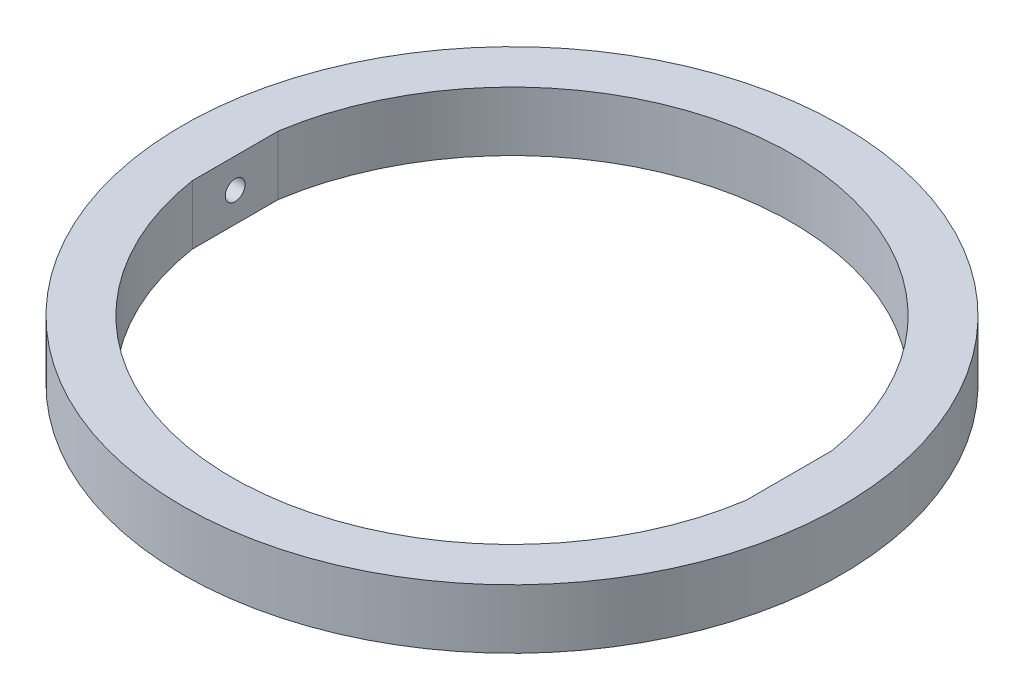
ISO-10303-21;
HEADER;
FILE_DESCRIPTION(('STEP AP214'),'2;1');
FILE_NAME('part.step','',(''),(''),'','','');
FILE_SCHEMA(('AUTOMOTIVE_DESIGN { 1 0 10303 214 1 1 1 1 }'));
ENDSEC;
DATA;
#1=APPLICATION_CONTEXT('core data for automotive mechanical design processes');
#2=APPLICATION_PROTOCOL_DEFINITION('international standard','automotive_design',2000,#1);
#3=PRODUCT_CONTEXT('',#1,'mechanical');
#4=PRODUCT('Part','Part','',(#3));
#5=PRODUCT_RELATED_PRODUCT_CATEGORY('part','',(#4));
#6=PRODUCT_DEFINITION_FORMATION('','',#4);
#7=PRODUCT_DEFINITION_CONTEXT('part definition',#1,'design');
#8=PRODUCT_DEFINITION('design','',#6,#7);
#9=PRODUCT_DEFINITION_SHAPE('','',#8);
#10=(LENGTH_UNIT() NAMED_UNIT(*) SI_UNIT(.MILLI.,.METRE.));
#11=(NAMED_UNIT(*) PLANE_ANGLE_UNIT() SI_UNIT($,.RADIAN.));
#12=(NAMED_UNIT(*) SI_UNIT($,.STERADIAN.) SOLID_ANGLE_UNIT());
#13=UNCERTAINTY_MEASURE_WITH_UNIT(LENGTH_MEASURE(1.E-05),#10,'distance_accuracy_value','');
#14=(GEOMETRIC_REPRESENTATION_CONTEXT(3) GLOBAL_UNCERTAINTY_ASSIGNED_CONTEXT((#13)) GLOBAL_UNIT_ASSIGNED_CONTEXT((#10,
#11,#12)) REPRESENTATION_CONTEXT('',''));
#15=CARTESIAN_POINT('',(0.,0.,0.));
#16=DIRECTION('',(0.,0.,1.));
#17=DIRECTION('',(1.,0.,0.));
#18=AXIS2_PLACEMENT_3D('',#15,#16,#17);
#19=CARTESIAN_POINT('',(0.,9.,0.));
#20=DIRECTION('',(0.,-1.,0.));
#21=DIRECTION('',(0.,0.,-1.));
#22=AXIS2_PLACEMENT_3D('',#19,#20,#21);
#23=CYLINDRICAL_SURFACE('',#22,42.5);
#24=CARTESIAN_POINT('',(0.,9.,0.));
#25=DIRECTION('',(0.,1.,0.));
#26=DIRECTION('',(0.,0.,1.));
#27=AXIS2_PLACEMENT_3D('',#24,#25,#26);
#28=CIRCLE('',#27,42.5);
#29=CARTESIAN_POINT('',(-42.,9.,6.50000000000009));
#30=VERTEX_POINT('',#29);
#31=CARTESIAN_POINT('',(42.,9.,6.50000000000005));
#32=VERTEX_POINT('',#31);
#33=EDGE_CURVE('E100',#30,#32,#28,.T.);
#34=ORIENTED_EDGE('',*,*,#33,.T.);
#35=DIRECTION('',(0.,1.,0.));
#36=VECTOR('',#35,1.);
#37=CARTESIAN_POINT('',(42.,0.,6.50000000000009));
#38=LINE('',#37,#36);
#39=CARTESIAN_POINT('',(42.,0.,6.50000000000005));
#40=VERTEX_POINT('',#39);
#41=EDGE_CURVE('E73',#40,#32,#38,.T.);
#42=ORIENTED_EDGE('',*,*,#41,.F.);
#43=CARTESIAN_POINT('',(0.,0.,0.));
#44=DIRECTION('',(0.,1.,0.));
#45=DIRECTION('',(0.,0.,1.));
#46=AXIS2_PLACEMENT_3D('',#43,#44,#45);
#47=CIRCLE('',#46,42.5);
#48=CARTESIAN_POINT('',(-42.,0.,6.50000000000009));
#49=VERTEX_POINT('',#48);
#50=EDGE_CURVE('E101',#49,#40,#47,.T.);
#51=ORIENTED_EDGE('',*,*,#50,.F.);
#52=DIRECTION('',(0.,1.,0.));
#53=VECTOR('',#52,1.);
#54=CARTESIAN_POINT('',(-42.,0.,6.50000000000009));
#55=LINE('',#54,#53);
#56=EDGE_CURVE('E127',#49,#30,#55,.T.);
#57=ORIENTED_EDGE('',*,*,#56,.T.);
#58=EDGE_LOOP('',(#34,#42,#51,#57));
#59=FACE_BOUND('',#58,.T.);
#60=ADVANCED_FACE('F47',(#59),#23,.F.);
#61=CARTESIAN_POINT('',(42.,0.,-6.50000000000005));
#62=VERTEX_POINT('',#61);
#63=CARTESIAN_POINT('',(-42.,0.,-6.50000000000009));
#64=VERTEX_POINT('',#63);
#65=EDGE_CURVE('E65',#62,#64,#47,.T.);
#66=ORIENTED_EDGE('',*,*,#65,.F.);
#67=DIRECTION('',(0.,1.,0.));
#68=VECTOR('',#67,1.);
#69=CARTESIAN_POINT('',(42.,0.,-6.50000000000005));
#70=LINE('',#69,#68);
#71=CARTESIAN_POINT('',(42.,9.,-6.50000000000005));
#72=VERTEX_POINT('',#71);
#73=EDGE_CURVE('E104',#62,#72,#70,.T.);
#74=ORIENTED_EDGE('',*,*,#73,.T.);
#75=CARTESIAN_POINT('',(-42.,9.,-6.50000000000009));
#76=VERTEX_POINT('',#75);
#77=EDGE_CURVE('E92',#72,#76,#28,.T.);
#78=ORIENTED_EDGE('',*,*,#77,.T.);
#79=DIRECTION('',(0.,1.,0.));
#80=VECTOR('',#79,1.);
#81=CARTESIAN_POINT('',(-42.,0.,-6.50000000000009));
#82=LINE('',#81,#80);
#83=EDGE_CURVE('E130',#64,#76,#82,.T.);
#84=ORIENTED_EDGE('',*,*,#83,.F.);
#85=EDGE_LOOP('',(#66,#74,#78,#84));
#86=FACE_BOUND('',#85,.T.);
#87=ADVANCED_FACE('F105',(#86),#23,.F.);
#88=CARTESIAN_POINT('',(0.,9.,0.));
#89=DIRECTION('',(0.,1.,0.));
#90=DIRECTION('',(0.,0.,1.));
#91=AXIS2_PLACEMENT_3D('',#88,#89,#90);
#92=PLANE('',#91);
#93=CARTESIAN_POINT('',(0.,9.,0.));
#94=DIRECTION('',(0.,1.,0.));
#95=DIRECTION('',(0.,0.,1.));
#96=AXIS2_PLACEMENT_3D('',#93,#94,#95);
#97=CIRCLE('',#96,50.);
#98=CARTESIAN_POINT('',(0.,9.,50.));
#99=VERTEX_POINT('',#98);
#100=EDGE_CURVE('E11',#99,#99,#97,.T.);
#101=ORIENTED_EDGE('',*,*,#100,.T.);
#102=EDGE_LOOP('',(#101));
#103=FACE_BOUND('',#102,.T.);
#104=ORIENTED_EDGE('',*,*,#33,.F.);
#105=DIRECTION('',(0.,0.,-1.));
#106=VECTOR('',#105,1.);
#107=CARTESIAN_POINT('',(-42.,9.,0.));
#108=LINE('',#107,#106);
#109=EDGE_CURVE('E97',#30,#76,#108,.T.);
#110=ORIENTED_EDGE('',*,*,#109,.T.);
#111=ORIENTED_EDGE('',*,*,#77,.F.);
#112=DIRECTION('',(0.,0.,-1.));
#113=VECTOR('',#112,1.);
#114=CARTESIAN_POINT('',(42.,9.,0.));
#115=LINE('',#114,#113);
#116=EDGE_CURVE('E95',#32,#72,#115,.T.);
#117=ORIENTED_EDGE('',*,*,#116,.F.);
#118=EDGE_LOOP('',(#104,#110,#111,#117));
#119=FACE_BOUND('',#118,.T.);
#120=ADVANCED_FACE('F93',(#103,#119),#92,.T.);
#121=CARTESIAN_POINT('',(0.,0.,0.));
#122=DIRECTION('',(0.,1.,0.));
#123=DIRECTION('',(0.,0.,1.));
#124=AXIS2_PLACEMENT_3D('',#121,#122,#123);
#125=PLANE('',#124);
#126=CARTESIAN_POINT('',(0.,0.,0.));
#127=DIRECTION('',(0.,1.,0.));
#128=DIRECTION('',(0.,0.,1.));
#129=AXIS2_PLACEMENT_3D('',#126,#127,#128);
#130=CIRCLE('',#129,50.);
#131=CARTESIAN_POINT('',(0.,0.,50.));
#132=VERTEX_POINT('',#131);
#133=EDGE_CURVE('E57',#132,#132,#130,.T.);
#134=ORIENTED_EDGE('',*,*,#133,.F.);
#135=EDGE_LOOP('',(#134));
#136=FACE_BOUND('',#135,.T.);
#137=ORIENTED_EDGE('',*,*,#50,.T.);
#138=DIRECTION('',(0.,0.,-1.));
#139=VECTOR('',#138,1.);
#140=CARTESIAN_POINT('',(42.,0.,0.));
#141=LINE('',#140,#139);
#142=EDGE_CURVE('E112',#40,#62,#141,.T.);
#143=ORIENTED_EDGE('',*,*,#142,.T.);
#144=ORIENTED_EDGE('',*,*,#65,.T.);
#145=DIRECTION('',(0.,0.,-1.));
#146=VECTOR('',#145,1.);
#147=CARTESIAN_POINT('',(-42.,0.,0.));
#148=LINE('',#147,#146);
#149=EDGE_CURVE('E123',#49,#64,#148,.T.);
#150=ORIENTED_EDGE('',*,*,#149,.F.);
#151=EDGE_LOOP('',(#137,#143,#144,#150));
#152=FACE_BOUND('',#151,.T.);
#153=ADVANCED_FACE('F143',(#136,#152),#125,.F.);
#154=CARTESIAN_POINT('',(0.,9.,0.));
#155=DIRECTION('',(0.,-1.,0.));
#156=DIRECTION('',(0.,0.,-1.));
#157=AXIS2_PLACEMENT_3D('',#154,#155,#156);
#158=CYLINDRICAL_SURFACE('',#157,50.);
#159=ORIENTED_EDGE('',*,*,#100,.F.);
#160=EDGE_LOOP('',(#159));
#161=FACE_BOUND('',#160,.T.);
#162=ORIENTED_EDGE('',*,*,#133,.T.);
#163=EDGE_LOOP('',(#162));
#164=FACE_BOUND('',#163,.T.);
#165=ADVANCED_FACE('F49',(#161,#164),#158,.T.);
#166=CARTESIAN_POINT('',(-42.,0.,0.));
#167=DIRECTION('',(1.,0.,0.));
#168=DIRECTION('',(0.,0.,-1.));
#169=AXIS2_PLACEMENT_3D('',#166,#167,#168);
#170=PLANE('',#169);
#171=CARTESIAN_POINT('',(-42.,4.5,0.));
#172=DIRECTION('',(1.,0.,0.));
#173=DIRECTION('',(0.,0.,-1.));
#174=AXIS2_PLACEMENT_3D('',#171,#172,#173);
#175=CIRCLE('',#174,1.5);
#176=CARTESIAN_POINT('',(-42.,4.5,-1.5));
#177=VERTEX_POINT('',#176);
#178=EDGE_CURVE('E113',#177,#177,#175,.F.);
#179=ORIENTED_EDGE('',*,*,#178,.T.);
#180=EDGE_LOOP('',(#179));
#181=FACE_BOUND('',#180,.T.);
#182=ORIENTED_EDGE('',*,*,#109,.F.);
#183=ORIENTED_EDGE('',*,*,#56,.F.);
#184=ORIENTED_EDGE('',*,*,#149,.T.);
#185=ORIENTED_EDGE('',*,*,#83,.T.);
#186=EDGE_LOOP('',(#182,#183,#184,#185));
#187=FACE_BOUND('',#186,.T.);
#188=ADVANCED_FACE('F149',(#181,#187),#170,.T.);
#189=CARTESIAN_POINT('',(42.,0.,0.));
#190=DIRECTION('',(1.,0.,0.));
#191=DIRECTION('',(0.,0.,-1.));
#192=AXIS2_PLACEMENT_3D('',#189,#190,#191);
#193=PLANE('',#192);
#194=CARTESIAN_POINT('',(42.,4.5,0.));
#195=DIRECTION('',(1.,0.,0.));
#196=DIRECTION('',(0.,0.,-1.));
#197=AXIS2_PLACEMENT_3D('',#194,#195,#196);
#198=CIRCLE('',#197,1.5);
#199=CARTESIAN_POINT('',(42.,4.5,-1.5));
#200=VERTEX_POINT('',#199);
#201=EDGE_CURVE('E51',#200,#200,#198,.F.);
#202=ORIENTED_EDGE('',*,*,#201,.F.);
#203=EDGE_LOOP('',(#202));
#204=FACE_BOUND('',#203,.T.);
#205=ORIENTED_EDGE('',*,*,#116,.T.);
#206=ORIENTED_EDGE('',*,*,#73,.F.);
#207=ORIENTED_EDGE('',*,*,#142,.F.);
#208=ORIENTED_EDGE('',*,*,#41,.T.);
#209=EDGE_LOOP('',(#205,#206,#207,#208));
#210=FACE_BOUND('',#209,.T.);
#211=ADVANCED_FACE('F110',(#204,#210),#193,.F.);
#212=CARTESIAN_POINT('',(47.,4.5,0.));
#213=DIRECTION('',(1.,0.,0.));
#214=DIRECTION('',(0.,0.,-1.));
#215=AXIS2_PLACEMENT_3D('',#212,#213,#214);
#216=PLANE('',#215);
#217=CARTESIAN_POINT('',(47.,4.5,0.));
#218=DIRECTION('',(1.,0.,0.));
#219=DIRECTION('',(0.,0.,-1.));
#220=AXIS2_PLACEMENT_3D('',#217,#218,#219);
#221=CIRCLE('',#220,1.5);
#222=CARTESIAN_POINT('',(47.,4.5,-1.5));
#223=VERTEX_POINT('',#222);
#224=EDGE_CURVE('E238',#223,#223,#221,.T.);
#225=ORIENTED_EDGE('',*,*,#224,.F.);
#226=EDGE_LOOP('',(#225));
#227=FACE_BOUND('',#226,.T.);
#228=ADVANCED_FACE('F156',(#227),#216,.F.);
#229=CARTESIAN_POINT('',(47.,4.5,0.));
#230=DIRECTION('',(-1.,0.,0.));
#231=DIRECTION('',(0.,0.,1.));
#232=AXIS2_PLACEMENT_3D('',#229,#230,#231);
#233=CYLINDRICAL_SURFACE('',#232,1.5);
#234=ORIENTED_EDGE('',*,*,#224,.T.);
#235=EDGE_LOOP('',(#234));
#236=FACE_BOUND('',#235,.T.);
#237=ORIENTED_EDGE('',*,*,#201,.T.);
#238=EDGE_LOOP('',(#237));
#239=FACE_BOUND('',#238,.T.);
#240=ADVANCED_FACE('F201',(#236,#239),#233,.F.);
#241=ORIENTED_EDGE('',*,*,#178,.F.);
#242=EDGE_LOOP('',(#241));
#243=FACE_BOUND('',#242,.T.);
#244=CARTESIAN_POINT('',(-47.,4.5,0.));
#245=DIRECTION('',(1.,0.,0.));
#246=DIRECTION('',(0.,0.,-1.));
#247=AXIS2_PLACEMENT_3D('',#244,#245,#246);
#248=CIRCLE('',#247,1.5);
#249=CARTESIAN_POINT('',(-47.,4.5,-1.5));
#250=VERTEX_POINT('',#249);
#251=EDGE_CURVE('E235',#250,#250,#248,.T.);
#252=ORIENTED_EDGE('',*,*,#251,.F.);
#253=EDGE_LOOP('',(#252));
#254=FACE_BOUND('',#253,.T.);
#255=ADVANCED_FACE('F211',(#243,#254),#233,.F.);
#256=CARTESIAN_POINT('',(-47.,4.5,0.));
#257=DIRECTION('',(1.,0.,0.));
#258=DIRECTION('',(0.,0.,-1.));
#259=AXIS2_PLACEMENT_3D('',#256,#257,#258);
#260=PLANE('',#259);
#261=ORIENTED_EDGE('',*,*,#251,.T.);
#262=EDGE_LOOP('',(#261));
#263=FACE_BOUND('',#262,.T.);
#264=ADVANCED_FACE('F221',(#263),#260,.T.);
#265=CLOSED_SHELL('',(#60,#87,#120,#153,#165,#188,#211,#228,#240,#255,#264));
#266=MANIFOLD_SOLID_BREP('B2',#265);
#267=ADVANCED_BREP_SHAPE_REPRESENTATION('',(#18,#266),#14);
#268=SHAPE_DEFINITION_REPRESENTATION(#9,#267);
ENDSEC;
END-ISO-10303-21;
